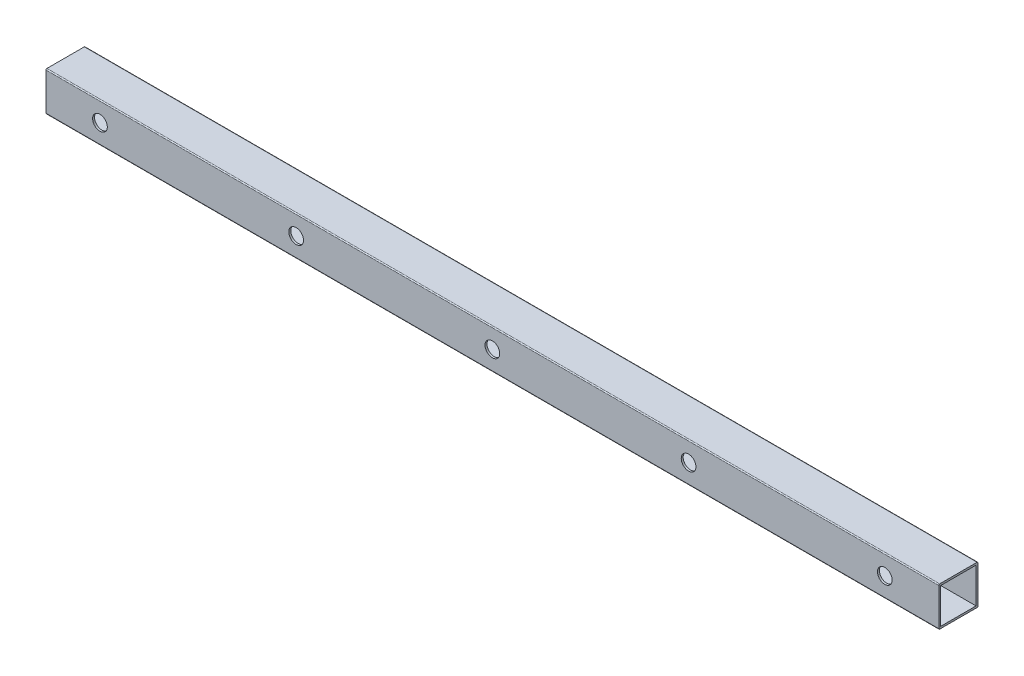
ISO-10303-21;
HEADER;
FILE_DESCRIPTION(('STEP AP214'),'2;1');
FILE_NAME('part.step','',(''),(''),'','','');
FILE_SCHEMA(('AUTOMOTIVE_DESIGN { 1 0 10303 214 1 1 1 1 }'));
ENDSEC;
DATA;
#1=APPLICATION_CONTEXT('core data for automotive mechanical design processes');
#2=APPLICATION_PROTOCOL_DEFINITION('international standard','automotive_design',2000,#1);
#3=PRODUCT_CONTEXT('',#1,'mechanical');
#4=PRODUCT('Part','Part','',(#3));
#5=PRODUCT_RELATED_PRODUCT_CATEGORY('part','',(#4));
#6=PRODUCT_DEFINITION_FORMATION('','',#4);
#7=PRODUCT_DEFINITION_CONTEXT('part definition',#1,'design');
#8=PRODUCT_DEFINITION('design','',#6,#7);
#9=PRODUCT_DEFINITION_SHAPE('','',#8);
#10=(LENGTH_UNIT() NAMED_UNIT(*) SI_UNIT(.MILLI.,.METRE.));
#11=(NAMED_UNIT(*) PLANE_ANGLE_UNIT() SI_UNIT($,.RADIAN.));
#12=(NAMED_UNIT(*) SI_UNIT($,.STERADIAN.) SOLID_ANGLE_UNIT());
#13=UNCERTAINTY_MEASURE_WITH_UNIT(LENGTH_MEASURE(1.E-05),#10,'distance_accuracy_value','');
#14=(GEOMETRIC_REPRESENTATION_CONTEXT(3) GLOBAL_UNCERTAINTY_ASSIGNED_CONTEXT((#13)) GLOBAL_UNIT_ASSIGNED_CONTEXT((#10,
#11,#12)) REPRESENTATION_CONTEXT('',''));
#15=CARTESIAN_POINT('',(0.,0.,0.));
#16=DIRECTION('',(0.,0.,1.));
#17=DIRECTION('',(1.,0.,0.));
#18=AXIS2_PLACEMENT_3D('',#15,#16,#17);
#19=CARTESIAN_POINT('',(227.5,9.49999999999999,9.5));
#20=DIRECTION('',(-1.,0.,0.));
#21=DIRECTION('',(0.,0.,1.));
#22=AXIS2_PLACEMENT_3D('',#19,#20,#21);
#23=PLANE('',#22);
#24=CARTESIAN_POINT('',(227.5,9.49999999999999,9.5));
#25=DIRECTION('',(1.,0.,0.));
#26=DIRECTION('',(0.,0.,1.));
#27=AXIS2_PLACEMENT_3D('',#24,#25,#26);
#28=CIRCLE('',#27,0.5);
#29=CARTESIAN_POINT('',(227.5,9.99999999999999,9.5));
#30=VERTEX_POINT('',#29);
#31=CARTESIAN_POINT('',(227.5,9.49999999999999,10.));
#32=VERTEX_POINT('',#31);
#33=EDGE_CURVE('E161',#30,#32,#28,.T.);
#34=ORIENTED_EDGE('',*,*,#33,.T.);
#35=DIRECTION('',(0.,-1.,0.));
#36=VECTOR('',#35,1.);
#37=CARTESIAN_POINT('',(227.5,-9.50000000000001,10.));
#38=LINE('',#37,#36);
#39=CARTESIAN_POINT('',(227.5,-9.50000000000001,10.));
#40=VERTEX_POINT('',#39);
#41=EDGE_CURVE('E164',#32,#40,#38,.T.);
#42=ORIENTED_EDGE('',*,*,#41,.T.);
#43=CARTESIAN_POINT('',(227.5,-9.50000000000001,9.5));
#44=DIRECTION('',(1.,0.,0.));
#45=DIRECTION('',(0.,0.,1.));
#46=AXIS2_PLACEMENT_3D('',#43,#44,#45);
#47=CIRCLE('',#46,0.5);
#48=CARTESIAN_POINT('',(227.5,-10.,9.5));
#49=VERTEX_POINT('',#48);
#50=EDGE_CURVE('E167',#40,#49,#47,.T.);
#51=ORIENTED_EDGE('',*,*,#50,.T.);
#52=DIRECTION('',(0.,0.,-1.));
#53=VECTOR('',#52,1.);
#54=CARTESIAN_POINT('',(227.5,-10.,9.5));
#55=LINE('',#54,#53);
#56=CARTESIAN_POINT('',(227.5,-10.,-9.49999999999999));
#57=VERTEX_POINT('',#56);
#58=EDGE_CURVE('E169',#49,#57,#55,.T.);
#59=ORIENTED_EDGE('',*,*,#58,.T.);
#60=CARTESIAN_POINT('',(227.5,-9.50000000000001,-9.5));
#61=DIRECTION('',(1.,0.,0.));
#62=DIRECTION('',(0.,0.,-1.));
#63=AXIS2_PLACEMENT_3D('',#60,#61,#62);
#64=CIRCLE('',#63,0.5);
#65=CARTESIAN_POINT('',(227.5,-9.50000000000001,-10.));
#66=VERTEX_POINT('',#65);
#67=EDGE_CURVE('E171',#57,#66,#64,.T.);
#68=ORIENTED_EDGE('',*,*,#67,.T.);
#69=DIRECTION('',(0.,1.,0.));
#70=VECTOR('',#69,1.);
#71=CARTESIAN_POINT('',(227.5,-9.50000000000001,-10.));
#72=LINE('',#71,#70);
#73=CARTESIAN_POINT('',(227.5,9.49999999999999,-10.));
#74=VERTEX_POINT('',#73);
#75=EDGE_CURVE('E173',#66,#74,#72,.T.);
#76=ORIENTED_EDGE('',*,*,#75,.T.);
#77=CARTESIAN_POINT('',(227.5,9.49999999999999,-9.5));
#78=DIRECTION('',(1.,0.,0.));
#79=DIRECTION('',(0.,0.,1.));
#80=AXIS2_PLACEMENT_3D('',#77,#78,#79);
#81=CIRCLE('',#80,0.5);
#82=CARTESIAN_POINT('',(227.5,9.99999999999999,-9.49999999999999));
#83=VERTEX_POINT('',#82);
#84=EDGE_CURVE('E175',#74,#83,#81,.T.);
#85=ORIENTED_EDGE('',*,*,#84,.T.);
#86=DIRECTION('',(0.,0.,1.));
#87=VECTOR('',#86,1.);
#88=CARTESIAN_POINT('',(227.5,9.99999999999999,9.5));
#89=LINE('',#88,#87);
#90=EDGE_CURVE('E177',#83,#30,#89,.T.);
#91=ORIENTED_EDGE('',*,*,#90,.T.);
#92=EDGE_LOOP('',(#34,#42,#51,#59,#68,#76,#85,#91));
#93=FACE_BOUND('',#92,.T.);
#94=DIRECTION('',(0.,0.,-1.));
#95=VECTOR('',#94,1.);
#96=CARTESIAN_POINT('',(227.5,-9.00000000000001,9.00000000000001));
#97=LINE('',#96,#95);
#98=CARTESIAN_POINT('',(227.5,-9.00000000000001,9.00000000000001));
#99=VERTEX_POINT('',#98);
#100=CARTESIAN_POINT('',(227.5,-9.00000000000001,-9.));
#101=VERTEX_POINT('',#100);
#102=EDGE_CURVE('E123',#99,#101,#97,.T.);
#103=ORIENTED_EDGE('',*,*,#102,.F.);
#104=DIRECTION('',(0.,-1.,0.));
#105=VECTOR('',#104,1.);
#106=CARTESIAN_POINT('',(227.5,-9.00000000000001,9.00000000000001));
#107=LINE('',#106,#105);
#108=CARTESIAN_POINT('',(227.5,8.99999999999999,9.00000000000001));
#109=VERTEX_POINT('',#108);
#110=EDGE_CURVE('E145',#109,#99,#107,.T.);
#111=ORIENTED_EDGE('',*,*,#110,.F.);
#112=DIRECTION('',(0.,0.,1.));
#113=VECTOR('',#112,1.);
#114=CARTESIAN_POINT('',(227.5,8.99999999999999,9.00000000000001));
#115=LINE('',#114,#113);
#116=CARTESIAN_POINT('',(227.5,8.99999999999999,-9.));
#117=VERTEX_POINT('',#116);
#118=EDGE_CURVE('E143',#117,#109,#115,.T.);
#119=ORIENTED_EDGE('',*,*,#118,.F.);
#120=DIRECTION('',(0.,1.,0.));
#121=VECTOR('',#120,1.);
#122=CARTESIAN_POINT('',(227.5,-9.00000000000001,-9.));
#123=LINE('',#122,#121);
#124=EDGE_CURVE('E131',#101,#117,#123,.T.);
#125=ORIENTED_EDGE('',*,*,#124,.F.);
#126=EDGE_LOOP('',(#103,#111,#119,#125));
#127=FACE_BOUND('',#126,.T.);
#128=ADVANCED_FACE('F32',(#93,#127),#23,.F.);
#129=CARTESIAN_POINT('',(-227.5,9.49999999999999,9.5));
#130=DIRECTION('',(-1.,0.,0.));
#131=DIRECTION('',(0.,0.,1.));
#132=AXIS2_PLACEMENT_3D('',#129,#130,#131);
#133=PLANE('',#132);
#134=CARTESIAN_POINT('',(-227.5,9.49999999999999,9.5));
#135=DIRECTION('',(1.,0.,0.));
#136=DIRECTION('',(0.,0.,1.));
#137=AXIS2_PLACEMENT_3D('',#134,#135,#136);
#138=CIRCLE('',#137,0.5);
#139=CARTESIAN_POINT('',(-227.5,9.99999999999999,9.5));
#140=VERTEX_POINT('',#139);
#141=CARTESIAN_POINT('',(-227.5,9.49999999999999,10.));
#142=VERTEX_POINT('',#141);
#143=EDGE_CURVE('E139',#140,#142,#138,.T.);
#144=ORIENTED_EDGE('',*,*,#143,.F.);
#145=DIRECTION('',(0.,0.,1.));
#146=VECTOR('',#145,1.);
#147=CARTESIAN_POINT('',(-227.5,9.99999999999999,9.5));
#148=LINE('',#147,#146);
#149=CARTESIAN_POINT('',(-227.5,9.99999999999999,-9.49999999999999));
#150=VERTEX_POINT('',#149);
#151=EDGE_CURVE('E165',#150,#140,#148,.T.);
#152=ORIENTED_EDGE('',*,*,#151,.F.);
#153=CARTESIAN_POINT('',(-227.5,9.49999999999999,-9.5));
#154=DIRECTION('',(1.,0.,0.));
#155=DIRECTION('',(0.,0.,1.));
#156=AXIS2_PLACEMENT_3D('',#153,#154,#155);
#157=CIRCLE('',#156,0.5);
#158=CARTESIAN_POINT('',(-227.5,9.49999999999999,-10.));
#159=VERTEX_POINT('',#158);
#160=EDGE_CURVE('E192',#159,#150,#157,.T.);
#161=ORIENTED_EDGE('',*,*,#160,.F.);
#162=DIRECTION('',(0.,1.,0.));
#163=VECTOR('',#162,1.);
#164=CARTESIAN_POINT('',(-227.5,-9.50000000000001,-10.));
#165=LINE('',#164,#163);
#166=CARTESIAN_POINT('',(-227.5,-9.50000000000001,-10.));
#167=VERTEX_POINT('',#166);
#168=EDGE_CURVE('E190',#167,#159,#165,.T.);
#169=ORIENTED_EDGE('',*,*,#168,.F.);
#170=CARTESIAN_POINT('',(-227.5,-9.50000000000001,-9.5));
#171=DIRECTION('',(1.,0.,0.));
#172=DIRECTION('',(0.,0.,-1.));
#173=AXIS2_PLACEMENT_3D('',#170,#171,#172);
#174=CIRCLE('',#173,0.5);
#175=CARTESIAN_POINT('',(-227.5,-10.,-9.49999999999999));
#176=VERTEX_POINT('',#175);
#177=EDGE_CURVE('E188',#176,#167,#174,.T.);
#178=ORIENTED_EDGE('',*,*,#177,.F.);
#179=DIRECTION('',(0.,0.,-1.));
#180=VECTOR('',#179,1.);
#181=CARTESIAN_POINT('',(-227.5,-10.,9.5));
#182=LINE('',#181,#180);
#183=CARTESIAN_POINT('',(-227.5,-10.,9.5));
#184=VERTEX_POINT('',#183);
#185=EDGE_CURVE('E186',#184,#176,#182,.T.);
#186=ORIENTED_EDGE('',*,*,#185,.F.);
#187=CARTESIAN_POINT('',(-227.5,-9.50000000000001,9.5));
#188=DIRECTION('',(1.,0.,0.));
#189=DIRECTION('',(0.,0.,1.));
#190=AXIS2_PLACEMENT_3D('',#187,#188,#189);
#191=CIRCLE('',#190,0.5);
#192=CARTESIAN_POINT('',(-227.5,-9.50000000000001,10.));
#193=VERTEX_POINT('',#192);
#194=EDGE_CURVE('E184',#193,#184,#191,.T.);
#195=ORIENTED_EDGE('',*,*,#194,.F.);
#196=DIRECTION('',(0.,-1.,0.));
#197=VECTOR('',#196,1.);
#198=CARTESIAN_POINT('',(-227.5,-9.50000000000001,10.));
#199=LINE('',#198,#197);
#200=EDGE_CURVE('E182',#142,#193,#199,.T.);
#201=ORIENTED_EDGE('',*,*,#200,.F.);
#202=EDGE_LOOP('',(#144,#152,#161,#169,#178,#186,#195,#201));
#203=FACE_BOUND('',#202,.T.);
#204=DIRECTION('',(0.,-1.,0.));
#205=VECTOR('',#204,1.);
#206=CARTESIAN_POINT('',(-227.5,-9.00000000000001,9.00000000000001));
#207=LINE('',#206,#205);
#208=CARTESIAN_POINT('',(-227.5,8.99999999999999,9.00000000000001));
#209=VERTEX_POINT('',#208);
#210=CARTESIAN_POINT('',(-227.5,-9.00000000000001,9.00000000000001));
#211=VERTEX_POINT('',#210);
#212=EDGE_CURVE('E132',#209,#211,#207,.T.);
#213=ORIENTED_EDGE('',*,*,#212,.T.);
#214=DIRECTION('',(0.,0.,-1.));
#215=VECTOR('',#214,1.);
#216=CARTESIAN_POINT('',(-227.5,-9.00000000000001,9.00000000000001));
#217=LINE('',#216,#215);
#218=CARTESIAN_POINT('',(-227.5,-9.00000000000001,-9.));
#219=VERTEX_POINT('',#218);
#220=EDGE_CURVE('E57',#211,#219,#217,.T.);
#221=ORIENTED_EDGE('',*,*,#220,.T.);
#222=DIRECTION('',(0.,1.,0.));
#223=VECTOR('',#222,1.);
#224=CARTESIAN_POINT('',(-227.5,-9.00000000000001,-9.));
#225=LINE('',#224,#223);
#226=CARTESIAN_POINT('',(-227.5,8.99999999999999,-9.));
#227=VERTEX_POINT('',#226);
#228=EDGE_CURVE('E138',#219,#227,#225,.T.);
#229=ORIENTED_EDGE('',*,*,#228,.T.);
#230=DIRECTION('',(0.,0.,1.));
#231=VECTOR('',#230,1.);
#232=CARTESIAN_POINT('',(-227.5,8.99999999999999,9.00000000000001));
#233=LINE('',#232,#231);
#234=EDGE_CURVE('E153',#227,#209,#233,.T.);
#235=ORIENTED_EDGE('',*,*,#234,.T.);
#236=EDGE_LOOP('',(#213,#221,#229,#235));
#237=FACE_BOUND('',#236,.T.);
#238=ADVANCED_FACE('F370',(#203,#237),#133,.T.);
#239=CARTESIAN_POINT('',(227.5,9.49999999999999,9.5));
#240=DIRECTION('',(-1.,0.,0.));
#241=DIRECTION('',(0.,0.,1.));
#242=AXIS2_PLACEMENT_3D('',#239,#240,#241);
#243=CYLINDRICAL_SURFACE('',#242,0.5);
#244=ORIENTED_EDGE('',*,*,#143,.T.);
#245=DIRECTION('',(-1.,0.,0.));
#246=VECTOR('',#245,1.);
#247=CARTESIAN_POINT('',(227.5,9.49999999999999,10.));
#248=LINE('',#247,#246);
#249=EDGE_CURVE('E11',#32,#142,#248,.T.);
#250=ORIENTED_EDGE('',*,*,#249,.F.);
#251=ORIENTED_EDGE('',*,*,#33,.F.);
#252=DIRECTION('',(-1.,0.,0.));
#253=VECTOR('',#252,1.);
#254=CARTESIAN_POINT('',(227.5,9.99999999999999,9.5));
#255=LINE('',#254,#253);
#256=EDGE_CURVE('E179',#30,#140,#255,.T.);
#257=ORIENTED_EDGE('',*,*,#256,.T.);
#258=EDGE_LOOP('',(#244,#250,#251,#257));
#259=FACE_BOUND('',#258,.T.);
#260=ADVANCED_FACE('F34',(#259),#243,.T.);
#261=CARTESIAN_POINT('',(227.5,-9.50000000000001,10.));
#262=DIRECTION('',(0.,0.,-1.));
#263=DIRECTION('',(-1.,0.,0.));
#264=AXIS2_PLACEMENT_3D('',#261,#262,#263);
#265=PLANE('',#264);
#266=CARTESIAN_POINT('',(-200.,0.,10.));
#267=DIRECTION('',(0.,0.,-1.));
#268=DIRECTION('',(-1.,0.,0.));
#269=AXIS2_PLACEMENT_3D('',#266,#267,#268);
#270=CIRCLE('',#269,3.74999999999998);
#271=CARTESIAN_POINT('',(-203.75,0.,10.));
#272=VERTEX_POINT('',#271);
#273=EDGE_CURVE('E237',#272,#272,#270,.T.);
#274=ORIENTED_EDGE('',*,*,#273,.T.);
#275=EDGE_LOOP('',(#274));
#276=FACE_BOUND('',#275,.T.);
#277=CARTESIAN_POINT('',(-100.,0.,10.));
#278=DIRECTION('',(0.,0.,-1.));
#279=DIRECTION('',(-1.,0.,0.));
#280=AXIS2_PLACEMENT_3D('',#277,#278,#279);
#281=CIRCLE('',#280,3.74999999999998);
#282=CARTESIAN_POINT('',(-103.75,0.,10.));
#283=VERTEX_POINT('',#282);
#284=EDGE_CURVE('E232',#283,#283,#281,.T.);
#285=ORIENTED_EDGE('',*,*,#284,.T.);
#286=EDGE_LOOP('',(#285));
#287=FACE_BOUND('',#286,.T.);
#288=CARTESIAN_POINT('',(0.,0.,10.));
#289=DIRECTION('',(0.,0.,-1.));
#290=DIRECTION('',(-1.,0.,0.));
#291=AXIS2_PLACEMENT_3D('',#288,#289,#290);
#292=CIRCLE('',#291,3.74999999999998);
#293=CARTESIAN_POINT('',(-3.74999999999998,0.,10.));
#294=VERTEX_POINT('',#293);
#295=EDGE_CURVE('E227',#294,#294,#292,.T.);
#296=ORIENTED_EDGE('',*,*,#295,.T.);
#297=EDGE_LOOP('',(#296));
#298=FACE_BOUND('',#297,.T.);
#299=CARTESIAN_POINT('',(100.,0.,10.));
#300=DIRECTION('',(0.,0.,-1.));
#301=DIRECTION('',(-1.,0.,0.));
#302=AXIS2_PLACEMENT_3D('',#299,#300,#301);
#303=CIRCLE('',#302,3.74999999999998);
#304=CARTESIAN_POINT('',(96.25,0.,10.));
#305=VERTEX_POINT('',#304);
#306=EDGE_CURVE('E222',#305,#305,#303,.T.);
#307=ORIENTED_EDGE('',*,*,#306,.T.);
#308=EDGE_LOOP('',(#307));
#309=FACE_BOUND('',#308,.T.);
#310=CARTESIAN_POINT('',(200.,0.,10.));
#311=DIRECTION('',(0.,0.,-1.));
#312=DIRECTION('',(-1.,0.,0.));
#313=AXIS2_PLACEMENT_3D('',#310,#311,#312);
#314=CIRCLE('',#313,3.74999999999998);
#315=CARTESIAN_POINT('',(196.25,0.,10.));
#316=VERTEX_POINT('',#315);
#317=EDGE_CURVE('E217',#316,#316,#314,.T.);
#318=ORIENTED_EDGE('',*,*,#317,.T.);
#319=EDGE_LOOP('',(#318));
#320=FACE_BOUND('',#319,.T.);
#321=ORIENTED_EDGE('',*,*,#200,.T.);
#322=DIRECTION('',(-1.,0.,0.));
#323=VECTOR('',#322,1.);
#324=CARTESIAN_POINT('',(227.5,-9.50000000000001,10.));
#325=LINE('',#324,#323);
#326=EDGE_CURVE('E41',#40,#193,#325,.T.);
#327=ORIENTED_EDGE('',*,*,#326,.F.);
#328=ORIENTED_EDGE('',*,*,#41,.F.);
#329=ORIENTED_EDGE('',*,*,#249,.T.);
#330=EDGE_LOOP('',(#321,#327,#328,#329));
#331=FACE_BOUND('',#330,.T.);
#332=ADVANCED_FACE('F400',(#276,#287,#298,#309,#320,#331),#265,.F.);
#333=CARTESIAN_POINT('',(227.5,-9.50000000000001,9.5));
#334=DIRECTION('',(-1.,0.,0.));
#335=DIRECTION('',(0.,0.,1.));
#336=AXIS2_PLACEMENT_3D('',#333,#334,#335);
#337=CYLINDRICAL_SURFACE('',#336,0.5);
#338=ORIENTED_EDGE('',*,*,#194,.T.);
#339=DIRECTION('',(-1.,0.,0.));
#340=VECTOR('',#339,1.);
#341=CARTESIAN_POINT('',(227.5,-10.,9.5));
#342=LINE('',#341,#340);
#343=EDGE_CURVE('E209',#49,#184,#342,.T.);
#344=ORIENTED_EDGE('',*,*,#343,.F.);
#345=ORIENTED_EDGE('',*,*,#50,.F.);
#346=ORIENTED_EDGE('',*,*,#326,.T.);
#347=EDGE_LOOP('',(#338,#344,#345,#346));
#348=FACE_BOUND('',#347,.T.);
#349=ADVANCED_FACE('F397',(#348),#337,.T.);
#350=CARTESIAN_POINT('',(227.5,-10.,9.5));
#351=DIRECTION('',(0.,1.,0.));
#352=DIRECTION('',(0.,0.,1.));
#353=AXIS2_PLACEMENT_3D('',#350,#351,#352);
#354=PLANE('',#353);
#355=ORIENTED_EDGE('',*,*,#185,.T.);
#356=DIRECTION('',(-1.,0.,0.));
#357=VECTOR('',#356,1.);
#358=CARTESIAN_POINT('',(227.5,-10.,-9.49999999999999));
#359=LINE('',#358,#357);
#360=EDGE_CURVE('E206',#57,#176,#359,.T.);
#361=ORIENTED_EDGE('',*,*,#360,.F.);
#362=ORIENTED_EDGE('',*,*,#58,.F.);
#363=ORIENTED_EDGE('',*,*,#343,.T.);
#364=EDGE_LOOP('',(#355,#361,#362,#363));
#365=FACE_BOUND('',#364,.T.);
#366=ADVANCED_FACE('F393',(#365),#354,.F.);
#367=CARTESIAN_POINT('',(227.5,-9.50000000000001,-9.5));
#368=DIRECTION('',(-1.,0.,0.));
#369=DIRECTION('',(0.,0.,1.));
#370=AXIS2_PLACEMENT_3D('',#367,#368,#369);
#371=CYLINDRICAL_SURFACE('',#370,0.5);
#372=ORIENTED_EDGE('',*,*,#177,.T.);
#373=DIRECTION('',(-1.,0.,0.));
#374=VECTOR('',#373,1.);
#375=CARTESIAN_POINT('',(227.5,-9.50000000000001,-10.));
#376=LINE('',#375,#374);
#377=EDGE_CURVE('E203',#66,#167,#376,.T.);
#378=ORIENTED_EDGE('',*,*,#377,.F.);
#379=ORIENTED_EDGE('',*,*,#67,.F.);
#380=ORIENTED_EDGE('',*,*,#360,.T.);
#381=EDGE_LOOP('',(#372,#378,#379,#380));
#382=FACE_BOUND('',#381,.T.);
#383=ADVANCED_FACE('F389',(#382),#371,.T.);
#384=CARTESIAN_POINT('',(227.5,-9.50000000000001,-10.));
#385=DIRECTION('',(0.,0.,1.));
#386=DIRECTION('',(1.,0.,0.));
#387=AXIS2_PLACEMENT_3D('',#384,#385,#386);
#388=PLANE('',#387);
#389=CARTESIAN_POINT('',(-225.,0.,-10.));
#390=DIRECTION('',(0.,0.,-1.));
#391=DIRECTION('',(-1.,0.,0.));
#392=AXIS2_PLACEMENT_3D('',#389,#390,#391);
#393=CIRCLE('',#392,2.24999999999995);
#394=CARTESIAN_POINT('',(-227.25,0.,-10.));
#395=VERTEX_POINT('',#394);
#396=EDGE_CURVE('E294',#395,#395,#393,.T.);
#397=ORIENTED_EDGE('',*,*,#396,.F.);
#398=EDGE_LOOP('',(#397));
#399=FACE_BOUND('',#398,.T.);
#400=CARTESIAN_POINT('',(-175.,0.,-10.));
#401=DIRECTION('',(0.,0.,-1.));
#402=DIRECTION('',(-1.,0.,0.));
#403=AXIS2_PLACEMENT_3D('',#400,#401,#402);
#404=CIRCLE('',#403,2.25000000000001);
#405=CARTESIAN_POINT('',(-177.25,0.,-10.));
#406=VERTEX_POINT('',#405);
#407=EDGE_CURVE('E284',#406,#406,#404,.T.);
#408=ORIENTED_EDGE('',*,*,#407,.F.);
#409=EDGE_LOOP('',(#408));
#410=FACE_BOUND('',#409,.T.);
#411=CARTESIAN_POINT('',(-150.,0.,-10.));
#412=DIRECTION('',(0.,0.,-1.));
#413=DIRECTION('',(-1.,0.,0.));
#414=AXIS2_PLACEMENT_3D('',#411,#412,#413);
#415=CIRCLE('',#414,2.25000000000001);
#416=CARTESIAN_POINT('',(-152.25,0.,-10.));
#417=VERTEX_POINT('',#416);
#418=EDGE_CURVE('E281',#417,#417,#415,.T.);
#419=ORIENTED_EDGE('',*,*,#418,.F.);
#420=EDGE_LOOP('',(#419));
#421=FACE_BOUND('',#420,.T.);
#422=CARTESIAN_POINT('',(-125.,0.,-10.));
#423=DIRECTION('',(0.,0.,-1.));
#424=DIRECTION('',(-1.,0.,0.));
#425=AXIS2_PLACEMENT_3D('',#422,#423,#424);
#426=CIRCLE('',#425,2.24999999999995);
#427=CARTESIAN_POINT('',(-127.25,0.,-10.));
#428=VERTEX_POINT('',#427);
#429=EDGE_CURVE('E278',#428,#428,#426,.T.);
#430=ORIENTED_EDGE('',*,*,#429,.F.);
#431=EDGE_LOOP('',(#430));
#432=FACE_BOUND('',#431,.T.);
#433=CARTESIAN_POINT('',(-75.,0.,-10.));
#434=DIRECTION('',(0.,0.,-1.));
#435=DIRECTION('',(-1.,0.,0.));
#436=AXIS2_PLACEMENT_3D('',#433,#434,#435);
#437=CIRCLE('',#436,2.25000000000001);
#438=CARTESIAN_POINT('',(-77.25,0.,-10.));
#439=VERTEX_POINT('',#438);
#440=EDGE_CURVE('E274',#439,#439,#437,.T.);
#441=ORIENTED_EDGE('',*,*,#440,.F.);
#442=EDGE_LOOP('',(#441));
#443=FACE_BOUND('',#442,.T.);
#444=CARTESIAN_POINT('',(-50.,0.,-10.));
#445=DIRECTION('',(0.,0.,-1.));
#446=DIRECTION('',(-1.,0.,0.));
#447=AXIS2_PLACEMENT_3D('',#444,#445,#446);
#448=CIRCLE('',#447,2.25000000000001);
#449=CARTESIAN_POINT('',(-52.25,0.,-10.));
#450=VERTEX_POINT('',#449);
#451=EDGE_CURVE('E270',#450,#450,#448,.T.);
#452=ORIENTED_EDGE('',*,*,#451,.F.);
#453=EDGE_LOOP('',(#452));
#454=FACE_BOUND('',#453,.T.);
#455=CARTESIAN_POINT('',(-25.,0.,-10.));
#456=DIRECTION('',(0.,0.,-1.));
#457=DIRECTION('',(-1.,0.,0.));
#458=AXIS2_PLACEMENT_3D('',#455,#456,#457);
#459=CIRCLE('',#458,2.24999999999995);
#460=CARTESIAN_POINT('',(-27.2499999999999,0.,-10.));
#461=VERTEX_POINT('',#460);
#462=EDGE_CURVE('E266',#461,#461,#459,.T.);
#463=ORIENTED_EDGE('',*,*,#462,.F.);
#464=EDGE_LOOP('',(#463));
#465=FACE_BOUND('',#464,.T.);
#466=CARTESIAN_POINT('',(25.,0.,-10.));
#467=DIRECTION('',(0.,0.,-1.));
#468=DIRECTION('',(-1.,0.,0.));
#469=AXIS2_PLACEMENT_3D('',#466,#467,#468);
#470=CIRCLE('',#469,2.25000000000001);
#471=CARTESIAN_POINT('',(22.75,0.,-10.));
#472=VERTEX_POINT('',#471);
#473=EDGE_CURVE('E262',#472,#472,#470,.T.);
#474=ORIENTED_EDGE('',*,*,#473,.F.);
#475=EDGE_LOOP('',(#474));
#476=FACE_BOUND('',#475,.T.);
#477=CARTESIAN_POINT('',(50.,0.,-10.));
#478=DIRECTION('',(0.,0.,-1.));
#479=DIRECTION('',(-1.,0.,0.));
#480=AXIS2_PLACEMENT_3D('',#477,#478,#479);
#481=CIRCLE('',#480,2.25000000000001);
#482=CARTESIAN_POINT('',(47.75,0.,-10.));
#483=VERTEX_POINT('',#482);
#484=EDGE_CURVE('E258',#483,#483,#481,.T.);
#485=ORIENTED_EDGE('',*,*,#484,.F.);
#486=EDGE_LOOP('',(#485));
#487=FACE_BOUND('',#486,.T.);
#488=CARTESIAN_POINT('',(75.,0.,-10.));
#489=DIRECTION('',(0.,0.,-1.));
#490=DIRECTION('',(-1.,0.,0.));
#491=AXIS2_PLACEMENT_3D('',#488,#489,#490);
#492=CIRCLE('',#491,2.24999999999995);
#493=CARTESIAN_POINT('',(72.7500000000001,0.,-10.));
#494=VERTEX_POINT('',#493);
#495=EDGE_CURVE('E254',#494,#494,#492,.T.);
#496=ORIENTED_EDGE('',*,*,#495,.F.);
#497=EDGE_LOOP('',(#496));
#498=FACE_BOUND('',#497,.T.);
#499=CARTESIAN_POINT('',(125.,0.,-10.));
#500=DIRECTION('',(0.,0.,-1.));
#501=DIRECTION('',(-1.,0.,0.));
#502=AXIS2_PLACEMENT_3D('',#499,#500,#501);
#503=CIRCLE('',#502,2.25000000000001);
#504=CARTESIAN_POINT('',(122.75,0.,-10.));
#505=VERTEX_POINT('',#504);
#506=EDGE_CURVE('E250',#505,#505,#503,.T.);
#507=ORIENTED_EDGE('',*,*,#506,.F.);
#508=EDGE_LOOP('',(#507));
#509=FACE_BOUND('',#508,.T.);
#510=CARTESIAN_POINT('',(150.,0.,-10.));
#511=DIRECTION('',(0.,0.,-1.));
#512=DIRECTION('',(-1.,0.,0.));
#513=AXIS2_PLACEMENT_3D('',#510,#511,#512);
#514=CIRCLE('',#513,2.25000000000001);
#515=CARTESIAN_POINT('',(147.75,0.,-10.));
#516=VERTEX_POINT('',#515);
#517=EDGE_CURVE('E246',#516,#516,#514,.T.);
#518=ORIENTED_EDGE('',*,*,#517,.F.);
#519=EDGE_LOOP('',(#518));
#520=FACE_BOUND('',#519,.T.);
#521=CARTESIAN_POINT('',(175.,0.,-10.));
#522=DIRECTION('',(0.,0.,-1.));
#523=DIRECTION('',(-1.,0.,0.));
#524=AXIS2_PLACEMENT_3D('',#521,#522,#523);
#525=CIRCLE('',#524,2.24999999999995);
#526=CARTESIAN_POINT('',(172.75,0.,-10.));
#527=VERTEX_POINT('',#526);
#528=EDGE_CURVE('E242',#527,#527,#525,.T.);
#529=ORIENTED_EDGE('',*,*,#528,.F.);
#530=EDGE_LOOP('',(#529));
#531=FACE_BOUND('',#530,.T.);
#532=CARTESIAN_POINT('',(-200.,0.,-10.));
#533=DIRECTION('',(0.,0.,-1.));
#534=DIRECTION('',(-1.,0.,0.));
#535=AXIS2_PLACEMENT_3D('',#532,#533,#534);
#536=CIRCLE('',#535,3.74999999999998);
#537=CARTESIAN_POINT('',(-203.75,0.,-10.));
#538=VERTEX_POINT('',#537);
#539=EDGE_CURVE('E241',#538,#538,#536,.T.);
#540=ORIENTED_EDGE('',*,*,#539,.F.);
#541=EDGE_LOOP('',(#540));
#542=FACE_BOUND('',#541,.T.);
#543=CARTESIAN_POINT('',(-100.,0.,-10.));
#544=DIRECTION('',(0.,0.,-1.));
#545=DIRECTION('',(-1.,0.,0.));
#546=AXIS2_PLACEMENT_3D('',#543,#544,#545);
#547=CIRCLE('',#546,3.74999999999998);
#548=CARTESIAN_POINT('',(-103.75,0.,-10.));
#549=VERTEX_POINT('',#548);
#550=EDGE_CURVE('E323',#549,#549,#547,.T.);
#551=ORIENTED_EDGE('',*,*,#550,.F.);
#552=EDGE_LOOP('',(#551));
#553=FACE_BOUND('',#552,.T.);
#554=CARTESIAN_POINT('',(0.,0.,-10.));
#555=DIRECTION('',(0.,0.,-1.));
#556=DIRECTION('',(-1.,0.,0.));
#557=AXIS2_PLACEMENT_3D('',#554,#555,#556);
#558=CIRCLE('',#557,3.74999999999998);
#559=CARTESIAN_POINT('',(-3.74999999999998,0.,-10.));
#560=VERTEX_POINT('',#559);
#561=EDGE_CURVE('E330',#560,#560,#558,.T.);
#562=ORIENTED_EDGE('',*,*,#561,.F.);
#563=EDGE_LOOP('',(#562));
#564=FACE_BOUND('',#563,.T.);
#565=CARTESIAN_POINT('',(100.,0.,-10.));
#566=DIRECTION('',(0.,0.,-1.));
#567=DIRECTION('',(-1.,0.,0.));
#568=AXIS2_PLACEMENT_3D('',#565,#566,#567);
#569=CIRCLE('',#568,3.74999999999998);
#570=CARTESIAN_POINT('',(96.25,0.,-10.));
#571=VERTEX_POINT('',#570);
#572=EDGE_CURVE('E337',#571,#571,#569,.T.);
#573=ORIENTED_EDGE('',*,*,#572,.F.);
#574=EDGE_LOOP('',(#573));
#575=FACE_BOUND('',#574,.T.);
#576=CARTESIAN_POINT('',(200.,0.,-10.));
#577=DIRECTION('',(0.,0.,-1.));
#578=DIRECTION('',(-1.,0.,0.));
#579=AXIS2_PLACEMENT_3D('',#576,#577,#578);
#580=CIRCLE('',#579,3.74999999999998);
#581=CARTESIAN_POINT('',(196.25,0.,-10.));
#582=VERTEX_POINT('',#581);
#583=EDGE_CURVE('E344',#582,#582,#580,.T.);
#584=ORIENTED_EDGE('',*,*,#583,.F.);
#585=EDGE_LOOP('',(#584));
#586=FACE_BOUND('',#585,.T.);
#587=ORIENTED_EDGE('',*,*,#168,.T.);
#588=DIRECTION('',(-1.,0.,0.));
#589=VECTOR('',#588,1.);
#590=CARTESIAN_POINT('',(227.5,9.49999999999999,-10.));
#591=LINE('',#590,#589);
#592=EDGE_CURVE('E200',#74,#159,#591,.T.);
#593=ORIENTED_EDGE('',*,*,#592,.F.);
#594=ORIENTED_EDGE('',*,*,#75,.F.);
#595=ORIENTED_EDGE('',*,*,#377,.T.);
#596=EDGE_LOOP('',(#587,#593,#594,#595));
#597=FACE_BOUND('',#596,.T.);
#598=ADVANCED_FACE('F385',(#399,#410,#421,#432,#443,#454,#465,#476,#487,#498,#509,#520,#531,
#542,#553,#564,#575,#586,#597),#388,.F.);
#599=CARTESIAN_POINT('',(227.5,9.49999999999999,-9.5));
#600=DIRECTION('',(-1.,0.,0.));
#601=DIRECTION('',(0.,0.,1.));
#602=AXIS2_PLACEMENT_3D('',#599,#600,#601);
#603=CYLINDRICAL_SURFACE('',#602,0.5);
#604=ORIENTED_EDGE('',*,*,#160,.T.);
#605=DIRECTION('',(-1.,0.,0.));
#606=VECTOR('',#605,1.);
#607=CARTESIAN_POINT('',(227.5,9.99999999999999,-9.49999999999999));
#608=LINE('',#607,#606);
#609=EDGE_CURVE('E197',#83,#150,#608,.T.);
#610=ORIENTED_EDGE('',*,*,#609,.F.);
#611=ORIENTED_EDGE('',*,*,#84,.F.);
#612=ORIENTED_EDGE('',*,*,#592,.T.);
#613=EDGE_LOOP('',(#604,#610,#611,#612));
#614=FACE_BOUND('',#613,.T.);
#615=ADVANCED_FACE('F381',(#614),#603,.T.);
#616=CARTESIAN_POINT('',(227.5,9.99999999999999,9.5));
#617=DIRECTION('',(0.,-1.,0.));
#618=DIRECTION('',(0.,0.,-1.));
#619=AXIS2_PLACEMENT_3D('',#616,#617,#618);
#620=PLANE('',#619);
#621=ORIENTED_EDGE('',*,*,#151,.T.);
#622=ORIENTED_EDGE('',*,*,#256,.F.);
#623=ORIENTED_EDGE('',*,*,#90,.F.);
#624=ORIENTED_EDGE('',*,*,#609,.T.);
#625=EDGE_LOOP('',(#621,#622,#623,#624));
#626=FACE_BOUND('',#625,.T.);
#627=ADVANCED_FACE('F365',(#626),#620,.F.);
#628=CARTESIAN_POINT('',(227.5,-9.00000000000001,9.00000000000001));
#629=DIRECTION('',(0.,1.,0.));
#630=DIRECTION('',(0.,0.,1.));
#631=AXIS2_PLACEMENT_3D('',#628,#629,#630);
#632=PLANE('',#631);
#633=ORIENTED_EDGE('',*,*,#220,.F.);
#634=DIRECTION('',(-1.,0.,0.));
#635=VECTOR('',#634,1.);
#636=CARTESIAN_POINT('',(227.5,-9.00000000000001,9.00000000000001));
#637=LINE('',#636,#635);
#638=EDGE_CURVE('E127',#99,#211,#637,.T.);
#639=ORIENTED_EDGE('',*,*,#638,.F.);
#640=ORIENTED_EDGE('',*,*,#102,.T.);
#641=DIRECTION('',(-1.,0.,0.));
#642=VECTOR('',#641,1.);
#643=CARTESIAN_POINT('',(227.5,-9.00000000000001,-9.));
#644=LINE('',#643,#642);
#645=EDGE_CURVE('E126',#101,#219,#644,.T.);
#646=ORIENTED_EDGE('',*,*,#645,.T.);
#647=EDGE_LOOP('',(#633,#639,#640,#646));
#648=FACE_BOUND('',#647,.T.);
#649=ADVANCED_FACE('F125',(#648),#632,.T.);
#650=CARTESIAN_POINT('',(227.5,-9.00000000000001,-9.));
#651=DIRECTION('',(0.,0.,1.));
#652=DIRECTION('',(0.,-1.,0.));
#653=AXIS2_PLACEMENT_3D('',#650,#651,#652);
#654=PLANE('',#653);
#655=CARTESIAN_POINT('',(-225.,0.,-9.));
#656=DIRECTION('',(0.,0.,1.));
#657=DIRECTION('',(0.,-1.,0.));
#658=AXIS2_PLACEMENT_3D('',#655,#656,#657);
#659=CIRCLE('',#658,2.24999999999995);
#660=CARTESIAN_POINT('',(-225.,-2.24999999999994,-9.));
#661=VERTEX_POINT('',#660);
#662=EDGE_CURVE('E36',#661,#661,#659,.T.);
#663=ORIENTED_EDGE('',*,*,#662,.F.);
#664=EDGE_LOOP('',(#663));
#665=FACE_BOUND('',#664,.T.);
#666=CARTESIAN_POINT('',(-175.,0.,-9.));
#667=DIRECTION('',(0.,0.,1.));
#668=DIRECTION('',(0.,-1.,0.));
#669=AXIS2_PLACEMENT_3D('',#666,#667,#668);
#670=CIRCLE('',#669,2.25000000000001);
#671=CARTESIAN_POINT('',(-175.,-2.25,-9.));
#672=VERTEX_POINT('',#671);
#673=EDGE_CURVE('E282',#672,#672,#670,.T.);
#674=ORIENTED_EDGE('',*,*,#673,.F.);
#675=EDGE_LOOP('',(#674));
#676=FACE_BOUND('',#675,.T.);
#677=CARTESIAN_POINT('',(-150.,0.,-9.));
#678=DIRECTION('',(0.,0.,1.));
#679=DIRECTION('',(0.,-1.,0.));
#680=AXIS2_PLACEMENT_3D('',#677,#678,#679);
#681=CIRCLE('',#680,2.25000000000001);
#682=CARTESIAN_POINT('',(-150.,-2.25,-9.));
#683=VERTEX_POINT('',#682);
#684=EDGE_CURVE('E279',#683,#683,#681,.T.);
#685=ORIENTED_EDGE('',*,*,#684,.F.);
#686=EDGE_LOOP('',(#685));
#687=FACE_BOUND('',#686,.T.);
#688=CARTESIAN_POINT('',(-125.,0.,-9.));
#689=DIRECTION('',(0.,0.,1.));
#690=DIRECTION('',(0.,-1.,0.));
#691=AXIS2_PLACEMENT_3D('',#688,#689,#690);
#692=CIRCLE('',#691,2.24999999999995);
#693=CARTESIAN_POINT('',(-125.,-2.24999999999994,-9.));
#694=VERTEX_POINT('',#693);
#695=EDGE_CURVE('E275',#694,#694,#692,.T.);
#696=ORIENTED_EDGE('',*,*,#695,.F.);
#697=EDGE_LOOP('',(#696));
#698=FACE_BOUND('',#697,.T.);
#699=CARTESIAN_POINT('',(-75.,0.,-9.));
#700=DIRECTION('',(0.,0.,1.));
#701=DIRECTION('',(0.,-1.,0.));
#702=AXIS2_PLACEMENT_3D('',#699,#700,#701);
#703=CIRCLE('',#702,2.25000000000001);
#704=CARTESIAN_POINT('',(-75.,-2.25,-9.));
#705=VERTEX_POINT('',#704);
#706=EDGE_CURVE('E271',#705,#705,#703,.T.);
#707=ORIENTED_EDGE('',*,*,#706,.F.);
#708=EDGE_LOOP('',(#707));
#709=FACE_BOUND('',#708,.T.);
#710=CARTESIAN_POINT('',(-50.,0.,-9.));
#711=DIRECTION('',(0.,0.,1.));
#712=DIRECTION('',(0.,-1.,0.));
#713=AXIS2_PLACEMENT_3D('',#710,#711,#712);
#714=CIRCLE('',#713,2.25000000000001);
#715=CARTESIAN_POINT('',(-50.,-2.25,-9.));
#716=VERTEX_POINT('',#715);
#717=EDGE_CURVE('E267',#716,#716,#714,.T.);
#718=ORIENTED_EDGE('',*,*,#717,.F.);
#719=EDGE_LOOP('',(#718));
#720=FACE_BOUND('',#719,.T.);
#721=CARTESIAN_POINT('',(-25.,0.,-9.));
#722=DIRECTION('',(0.,0.,1.));
#723=DIRECTION('',(0.,-1.,0.));
#724=AXIS2_PLACEMENT_3D('',#721,#722,#723);
#725=CIRCLE('',#724,2.24999999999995);
#726=CARTESIAN_POINT('',(-25.,-2.24999999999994,-9.));
#727=VERTEX_POINT('',#726);
#728=EDGE_CURVE('E263',#727,#727,#725,.T.);
#729=ORIENTED_EDGE('',*,*,#728,.F.);
#730=EDGE_LOOP('',(#729));
#731=FACE_BOUND('',#730,.T.);
#732=CARTESIAN_POINT('',(25.,0.,-9.));
#733=DIRECTION('',(0.,0.,1.));
#734=DIRECTION('',(0.,-1.,0.));
#735=AXIS2_PLACEMENT_3D('',#732,#733,#734);
#736=CIRCLE('',#735,2.25000000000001);
#737=CARTESIAN_POINT('',(25.,-2.25,-9.));
#738=VERTEX_POINT('',#737);
#739=EDGE_CURVE('E259',#738,#738,#736,.T.);
#740=ORIENTED_EDGE('',*,*,#739,.F.);
#741=EDGE_LOOP('',(#740));
#742=FACE_BOUND('',#741,.T.);
#743=CARTESIAN_POINT('',(50.,0.,-9.));
#744=DIRECTION('',(0.,0.,1.));
#745=DIRECTION('',(0.,-1.,0.));
#746=AXIS2_PLACEMENT_3D('',#743,#744,#745);
#747=CIRCLE('',#746,2.25000000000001);
#748=CARTESIAN_POINT('',(50.,-2.25,-9.));
#749=VERTEX_POINT('',#748);
#750=EDGE_CURVE('E255',#749,#749,#747,.T.);
#751=ORIENTED_EDGE('',*,*,#750,.F.);
#752=EDGE_LOOP('',(#751));
#753=FACE_BOUND('',#752,.T.);
#754=CARTESIAN_POINT('',(75.,0.,-9.));
#755=DIRECTION('',(0.,0.,1.));
#756=DIRECTION('',(0.,-1.,0.));
#757=AXIS2_PLACEMENT_3D('',#754,#755,#756);
#758=CIRCLE('',#757,2.24999999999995);
#759=CARTESIAN_POINT('',(75.,-2.24999999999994,-9.));
#760=VERTEX_POINT('',#759);
#761=EDGE_CURVE('E251',#760,#760,#758,.T.);
#762=ORIENTED_EDGE('',*,*,#761,.F.);
#763=EDGE_LOOP('',(#762));
#764=FACE_BOUND('',#763,.T.);
#765=CARTESIAN_POINT('',(125.,0.,-9.));
#766=DIRECTION('',(0.,0.,1.));
#767=DIRECTION('',(0.,-1.,0.));
#768=AXIS2_PLACEMENT_3D('',#765,#766,#767);
#769=CIRCLE('',#768,2.25000000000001);
#770=CARTESIAN_POINT('',(125.,-2.25,-9.));
#771=VERTEX_POINT('',#770);
#772=EDGE_CURVE('E247',#771,#771,#769,.T.);
#773=ORIENTED_EDGE('',*,*,#772,.F.);
#774=EDGE_LOOP('',(#773));
#775=FACE_BOUND('',#774,.T.);
#776=CARTESIAN_POINT('',(150.,0.,-9.));
#777=DIRECTION('',(0.,0.,1.));
#778=DIRECTION('',(0.,-1.,0.));
#779=AXIS2_PLACEMENT_3D('',#776,#777,#778);
#780=CIRCLE('',#779,2.25000000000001);
#781=CARTESIAN_POINT('',(150.,-2.25,-9.));
#782=VERTEX_POINT('',#781);
#783=EDGE_CURVE('E243',#782,#782,#780,.T.);
#784=ORIENTED_EDGE('',*,*,#783,.F.);
#785=EDGE_LOOP('',(#784));
#786=FACE_BOUND('',#785,.T.);
#787=CARTESIAN_POINT('',(175.,0.,-9.));
#788=DIRECTION('',(0.,0.,1.));
#789=DIRECTION('',(0.,-1.,0.));
#790=AXIS2_PLACEMENT_3D('',#787,#788,#789);
#791=CIRCLE('',#790,2.24999999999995);
#792=CARTESIAN_POINT('',(175.,-2.24999999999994,-9.));
#793=VERTEX_POINT('',#792);
#794=EDGE_CURVE('E238',#793,#793,#791,.T.);
#795=ORIENTED_EDGE('',*,*,#794,.F.);
#796=EDGE_LOOP('',(#795));
#797=FACE_BOUND('',#796,.T.);
#798=CARTESIAN_POINT('',(-200.,0.,-9.));
#799=DIRECTION('',(0.,0.,1.));
#800=DIRECTION('',(0.,-1.,0.));
#801=AXIS2_PLACEMENT_3D('',#798,#799,#800);
#802=CIRCLE('',#801,3.74999999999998);
#803=CARTESIAN_POINT('',(-200.,-3.74999999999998,-9.));
#804=VERTEX_POINT('',#803);
#805=EDGE_CURVE('E236',#804,#804,#802,.T.);
#806=ORIENTED_EDGE('',*,*,#805,.F.);
#807=EDGE_LOOP('',(#806));
#808=FACE_BOUND('',#807,.T.);
#809=CARTESIAN_POINT('',(-100.,0.,-9.));
#810=DIRECTION('',(0.,0.,1.));
#811=DIRECTION('',(0.,-1.,0.));
#812=AXIS2_PLACEMENT_3D('',#809,#810,#811);
#813=CIRCLE('',#812,3.74999999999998);
#814=CARTESIAN_POINT('',(-100.,-3.74999999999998,-9.));
#815=VERTEX_POINT('',#814);
#816=EDGE_CURVE('E231',#815,#815,#813,.T.);
#817=ORIENTED_EDGE('',*,*,#816,.F.);
#818=EDGE_LOOP('',(#817));
#819=FACE_BOUND('',#818,.T.);
#820=CARTESIAN_POINT('',(0.,0.,-9.));
#821=DIRECTION('',(0.,0.,1.));
#822=DIRECTION('',(0.,-1.,0.));
#823=AXIS2_PLACEMENT_3D('',#820,#821,#822);
#824=CIRCLE('',#823,3.74999999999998);
#825=CARTESIAN_POINT('',(0.,-3.74999999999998,-9.));
#826=VERTEX_POINT('',#825);
#827=EDGE_CURVE('E226',#826,#826,#824,.T.);
#828=ORIENTED_EDGE('',*,*,#827,.F.);
#829=EDGE_LOOP('',(#828));
#830=FACE_BOUND('',#829,.T.);
#831=CARTESIAN_POINT('',(100.,0.,-9.));
#832=DIRECTION('',(0.,0.,1.));
#833=DIRECTION('',(0.,-1.,0.));
#834=AXIS2_PLACEMENT_3D('',#831,#832,#833);
#835=CIRCLE('',#834,3.74999999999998);
#836=CARTESIAN_POINT('',(100.,-3.74999999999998,-9.));
#837=VERTEX_POINT('',#836);
#838=EDGE_CURVE('E221',#837,#837,#835,.T.);
#839=ORIENTED_EDGE('',*,*,#838,.F.);
#840=EDGE_LOOP('',(#839));
#841=FACE_BOUND('',#840,.T.);
#842=CARTESIAN_POINT('',(200.,0.,-9.));
#843=DIRECTION('',(0.,0.,1.));
#844=DIRECTION('',(0.,-1.,0.));
#845=AXIS2_PLACEMENT_3D('',#842,#843,#844);
#846=CIRCLE('',#845,3.74999999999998);
#847=CARTESIAN_POINT('',(200.,-3.74999999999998,-9.));
#848=VERTEX_POINT('',#847);
#849=EDGE_CURVE('E151',#848,#848,#846,.T.);
#850=ORIENTED_EDGE('',*,*,#849,.F.);
#851=EDGE_LOOP('',(#850));
#852=FACE_BOUND('',#851,.T.);
#853=ORIENTED_EDGE('',*,*,#228,.F.);
#854=ORIENTED_EDGE('',*,*,#645,.F.);
#855=ORIENTED_EDGE('',*,*,#124,.T.);
#856=DIRECTION('',(-1.,0.,0.));
#857=VECTOR('',#856,1.);
#858=CARTESIAN_POINT('',(227.5,8.99999999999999,-9.));
#859=LINE('',#858,#857);
#860=EDGE_CURVE('E140',#117,#227,#859,.T.);
#861=ORIENTED_EDGE('',*,*,#860,.T.);
#862=EDGE_LOOP('',(#853,#854,#855,#861));
#863=FACE_BOUND('',#862,.T.);
#864=ADVANCED_FACE('F135',(#665,#676,#687,#698,#709,#720,#731,#742,#753,#764,#775,#786,#797,
#808,#819,#830,#841,#852,#863),#654,.T.);
#865=CARTESIAN_POINT('',(227.5,8.99999999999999,9.00000000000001));
#866=DIRECTION('',(0.,-1.,0.));
#867=DIRECTION('',(0.,0.,-1.));
#868=AXIS2_PLACEMENT_3D('',#865,#866,#867);
#869=PLANE('',#868);
#870=ORIENTED_EDGE('',*,*,#234,.F.);
#871=ORIENTED_EDGE('',*,*,#860,.F.);
#872=ORIENTED_EDGE('',*,*,#118,.T.);
#873=DIRECTION('',(-1.,0.,0.));
#874=VECTOR('',#873,1.);
#875=CARTESIAN_POINT('',(227.5,8.99999999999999,9.00000000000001));
#876=LINE('',#875,#874);
#877=EDGE_CURVE('E49',#109,#209,#876,.T.);
#878=ORIENTED_EDGE('',*,*,#877,.T.);
#879=EDGE_LOOP('',(#870,#871,#872,#878));
#880=FACE_BOUND('',#879,.T.);
#881=ADVANCED_FACE('F355',(#880),#869,.T.);
#882=CARTESIAN_POINT('',(227.5,-9.00000000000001,9.00000000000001));
#883=DIRECTION('',(0.,0.,-1.));
#884=DIRECTION('',(-1.,0.,0.));
#885=AXIS2_PLACEMENT_3D('',#882,#883,#884);
#886=PLANE('',#885);
#887=CARTESIAN_POINT('',(-200.,0.,9.00000000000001));
#888=DIRECTION('',(0.,0.,-1.));
#889=DIRECTION('',(-1.,0.,0.));
#890=AXIS2_PLACEMENT_3D('',#887,#888,#889);
#891=CIRCLE('',#890,3.74999999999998);
#892=CARTESIAN_POINT('',(-203.75,0.,9.00000000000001));
#893=VERTEX_POINT('',#892);
#894=EDGE_CURVE('E233',#893,#893,#891,.T.);
#895=ORIENTED_EDGE('',*,*,#894,.F.);
#896=EDGE_LOOP('',(#895));
#897=FACE_BOUND('',#896,.T.);
#898=CARTESIAN_POINT('',(-100.,0.,9.00000000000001));
#899=DIRECTION('',(0.,0.,-1.));
#900=DIRECTION('',(-1.,0.,0.));
#901=AXIS2_PLACEMENT_3D('',#898,#899,#900);
#902=CIRCLE('',#901,3.74999999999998);
#903=CARTESIAN_POINT('',(-103.75,0.,9.00000000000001));
#904=VERTEX_POINT('',#903);
#905=EDGE_CURVE('E228',#904,#904,#902,.T.);
#906=ORIENTED_EDGE('',*,*,#905,.F.);
#907=EDGE_LOOP('',(#906));
#908=FACE_BOUND('',#907,.T.);
#909=CARTESIAN_POINT('',(0.,0.,9.00000000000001));
#910=DIRECTION('',(0.,0.,-1.));
#911=DIRECTION('',(-1.,0.,0.));
#912=AXIS2_PLACEMENT_3D('',#909,#910,#911);
#913=CIRCLE('',#912,3.74999999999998);
#914=CARTESIAN_POINT('',(-3.74999999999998,0.,9.00000000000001));
#915=VERTEX_POINT('',#914);
#916=EDGE_CURVE('E223',#915,#915,#913,.T.);
#917=ORIENTED_EDGE('',*,*,#916,.F.);
#918=EDGE_LOOP('',(#917));
#919=FACE_BOUND('',#918,.T.);
#920=CARTESIAN_POINT('',(100.,0.,9.00000000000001));
#921=DIRECTION('',(0.,0.,-1.));
#922=DIRECTION('',(-1.,0.,0.));
#923=AXIS2_PLACEMENT_3D('',#920,#921,#922);
#924=CIRCLE('',#923,3.74999999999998);
#925=CARTESIAN_POINT('',(96.25,0.,9.00000000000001));
#926=VERTEX_POINT('',#925);
#927=EDGE_CURVE('E218',#926,#926,#924,.T.);
#928=ORIENTED_EDGE('',*,*,#927,.F.);
#929=EDGE_LOOP('',(#928));
#930=FACE_BOUND('',#929,.T.);
#931=CARTESIAN_POINT('',(200.,0.,9.00000000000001));
#932=DIRECTION('',(0.,0.,-1.));
#933=DIRECTION('',(-1.,0.,0.));
#934=AXIS2_PLACEMENT_3D('',#931,#932,#933);
#935=CIRCLE('',#934,3.74999999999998);
#936=CARTESIAN_POINT('',(196.25,0.,9.00000000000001));
#937=VERTEX_POINT('',#936);
#938=EDGE_CURVE('E214',#937,#937,#935,.T.);
#939=ORIENTED_EDGE('',*,*,#938,.F.);
#940=EDGE_LOOP('',(#939));
#941=FACE_BOUND('',#940,.T.);
#942=ORIENTED_EDGE('',*,*,#212,.F.);
#943=ORIENTED_EDGE('',*,*,#877,.F.);
#944=ORIENTED_EDGE('',*,*,#110,.T.);
#945=ORIENTED_EDGE('',*,*,#638,.T.);
#946=EDGE_LOOP('',(#942,#943,#944,#945));
#947=FACE_BOUND('',#946,.T.);
#948=ADVANCED_FACE('F362',(#897,#908,#919,#930,#941,#947),#886,.T.);
#949=CARTESIAN_POINT('',(200.,0.,10.));
#950=DIRECTION('',(0.,0.,-1.));
#951=DIRECTION('',(-1.,0.,0.));
#952=AXIS2_PLACEMENT_3D('',#949,#950,#951);
#953=CYLINDRICAL_SURFACE('',#952,3.74999999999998);
#954=ORIENTED_EDGE('',*,*,#938,.T.);
#955=EDGE_LOOP('',(#954));
#956=FACE_BOUND('',#955,.T.);
#957=ORIENTED_EDGE('',*,*,#317,.F.);
#958=EDGE_LOOP('',(#957));
#959=FACE_BOUND('',#958,.T.);
#960=ADVANCED_FACE('F444',(#956,#959),#953,.F.);
#961=ORIENTED_EDGE('',*,*,#849,.T.);
#962=EDGE_LOOP('',(#961));
#963=FACE_BOUND('',#962,.T.);
#964=ORIENTED_EDGE('',*,*,#583,.T.);
#965=EDGE_LOOP('',(#964));
#966=FACE_BOUND('',#965,.T.);
#967=ADVANCED_FACE('F351',(#963,#966),#953,.F.);
#968=CARTESIAN_POINT('',(100.,0.,10.));
#969=DIRECTION('',(0.,0.,-1.));
#970=DIRECTION('',(-1.,0.,0.));
#971=AXIS2_PLACEMENT_3D('',#968,#969,#970);
#972=CYLINDRICAL_SURFACE('',#971,3.74999999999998);
#973=ORIENTED_EDGE('',*,*,#927,.T.);
#974=EDGE_LOOP('',(#973));
#975=FACE_BOUND('',#974,.T.);
#976=ORIENTED_EDGE('',*,*,#306,.F.);
#977=EDGE_LOOP('',(#976));
#978=FACE_BOUND('',#977,.T.);
#979=ADVANCED_FACE('F455',(#975,#978),#972,.F.);
#980=ORIENTED_EDGE('',*,*,#838,.T.);
#981=EDGE_LOOP('',(#980));
#982=FACE_BOUND('',#981,.T.);
#983=ORIENTED_EDGE('',*,*,#572,.T.);
#984=EDGE_LOOP('',(#983));
#985=FACE_BOUND('',#984,.T.);
#986=ADVANCED_FACE('F458',(#982,#985),#972,.F.);
#987=CARTESIAN_POINT('',(0.,0.,10.));
#988=DIRECTION('',(0.,0.,-1.));
#989=DIRECTION('',(-1.,0.,0.));
#990=AXIS2_PLACEMENT_3D('',#987,#988,#989);
#991=CYLINDRICAL_SURFACE('',#990,3.74999999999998);
#992=ORIENTED_EDGE('',*,*,#916,.T.);
#993=EDGE_LOOP('',(#992));
#994=FACE_BOUND('',#993,.T.);
#995=ORIENTED_EDGE('',*,*,#295,.F.);
#996=EDGE_LOOP('',(#995));
#997=FACE_BOUND('',#996,.T.);
#998=ADVANCED_FACE('F460',(#994,#997),#991,.F.);
#999=ORIENTED_EDGE('',*,*,#827,.T.);
#1000=EDGE_LOOP('',(#999));
#1001=FACE_BOUND('',#1000,.T.);
#1002=ORIENTED_EDGE('',*,*,#561,.T.);
#1003=EDGE_LOOP('',(#1002));
#1004=FACE_BOUND('',#1003,.T.);
#1005=ADVANCED_FACE('F463',(#1001,#1004),#991,.F.);
#1006=CARTESIAN_POINT('',(-100.,0.,10.));
#1007=DIRECTION('',(0.,0.,-1.));
#1008=DIRECTION('',(-1.,0.,0.));
#1009=AXIS2_PLACEMENT_3D('',#1006,#1007,#1008);
#1010=CYLINDRICAL_SURFACE('',#1009,3.74999999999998);
#1011=ORIENTED_EDGE('',*,*,#905,.T.);
#1012=EDGE_LOOP('',(#1011));
#1013=FACE_BOUND('',#1012,.T.);
#1014=ORIENTED_EDGE('',*,*,#284,.F.);
#1015=EDGE_LOOP('',(#1014));
#1016=FACE_BOUND('',#1015,.T.);
#1017=ADVANCED_FACE('F465',(#1013,#1016),#1010,.F.);
#1018=ORIENTED_EDGE('',*,*,#816,.T.);
#1019=EDGE_LOOP('',(#1018));
#1020=FACE_BOUND('',#1019,.T.);
#1021=ORIENTED_EDGE('',*,*,#550,.T.);
#1022=EDGE_LOOP('',(#1021));
#1023=FACE_BOUND('',#1022,.T.);
#1024=ADVANCED_FACE('F468',(#1020,#1023),#1010,.F.);
#1025=CARTESIAN_POINT('',(-200.,0.,10.));
#1026=DIRECTION('',(0.,0.,-1.));
#1027=DIRECTION('',(-1.,0.,0.));
#1028=AXIS2_PLACEMENT_3D('',#1025,#1026,#1027);
#1029=CYLINDRICAL_SURFACE('',#1028,3.74999999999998);
#1030=ORIENTED_EDGE('',*,*,#894,.T.);
#1031=EDGE_LOOP('',(#1030));
#1032=FACE_BOUND('',#1031,.T.);
#1033=ORIENTED_EDGE('',*,*,#273,.F.);
#1034=EDGE_LOOP('',(#1033));
#1035=FACE_BOUND('',#1034,.T.);
#1036=ADVANCED_FACE('F470',(#1032,#1035),#1029,.F.);
#1037=ORIENTED_EDGE('',*,*,#805,.T.);
#1038=EDGE_LOOP('',(#1037));
#1039=FACE_BOUND('',#1038,.T.);
#1040=ORIENTED_EDGE('',*,*,#539,.T.);
#1041=EDGE_LOOP('',(#1040));
#1042=FACE_BOUND('',#1041,.T.);
#1043=ADVANCED_FACE('F473',(#1039,#1042),#1029,.F.);
#1044=CARTESIAN_POINT('',(175.,0.,-8.));
#1045=DIRECTION('',(0.,0.,-1.));
#1046=DIRECTION('',(-1.,0.,0.));
#1047=AXIS2_PLACEMENT_3D('',#1044,#1045,#1046);
#1048=CYLINDRICAL_SURFACE('',#1047,2.24999999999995);
#1049=ORIENTED_EDGE('',*,*,#794,.T.);
#1050=EDGE_LOOP('',(#1049));
#1051=FACE_BOUND('',#1050,.T.);
#1052=ORIENTED_EDGE('',*,*,#528,.T.);
#1053=EDGE_LOOP('',(#1052));
#1054=FACE_BOUND('',#1053,.T.);
#1055=ADVANCED_FACE('F475',(#1051,#1054),#1048,.F.);
#1056=CARTESIAN_POINT('',(150.,0.,-8.));
#1057=DIRECTION('',(0.,0.,-1.));
#1058=DIRECTION('',(-1.,0.,0.));
#1059=AXIS2_PLACEMENT_3D('',#1056,#1057,#1058);
#1060=CYLINDRICAL_SURFACE('',#1059,2.25000000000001);
#1061=ORIENTED_EDGE('',*,*,#783,.T.);
#1062=EDGE_LOOP('',(#1061));
#1063=FACE_BOUND('',#1062,.T.);
#1064=ORIENTED_EDGE('',*,*,#517,.T.);
#1065=EDGE_LOOP('',(#1064));
#1066=FACE_BOUND('',#1065,.T.);
#1067=ADVANCED_FACE('F478',(#1063,#1066),#1060,.F.);
#1068=CARTESIAN_POINT('',(125.,0.,-8.));
#1069=DIRECTION('',(0.,0.,-1.));
#1070=DIRECTION('',(-1.,0.,0.));
#1071=AXIS2_PLACEMENT_3D('',#1068,#1069,#1070);
#1072=CYLINDRICAL_SURFACE('',#1071,2.25000000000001);
#1073=ORIENTED_EDGE('',*,*,#772,.T.);
#1074=EDGE_LOOP('',(#1073));
#1075=FACE_BOUND('',#1074,.T.);
#1076=ORIENTED_EDGE('',*,*,#506,.T.);
#1077=EDGE_LOOP('',(#1076));
#1078=FACE_BOUND('',#1077,.T.);
#1079=ADVANCED_FACE('F482',(#1075,#1078),#1072,.F.);
#1080=CARTESIAN_POINT('',(75.,0.,-8.));
#1081=DIRECTION('',(0.,0.,-1.));
#1082=DIRECTION('',(-1.,0.,0.));
#1083=AXIS2_PLACEMENT_3D('',#1080,#1081,#1082);
#1084=CYLINDRICAL_SURFACE('',#1083,2.24999999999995);
#1085=ORIENTED_EDGE('',*,*,#761,.T.);
#1086=EDGE_LOOP('',(#1085));
#1087=FACE_BOUND('',#1086,.T.);
#1088=ORIENTED_EDGE('',*,*,#495,.T.);
#1089=EDGE_LOOP('',(#1088));
#1090=FACE_BOUND('',#1089,.T.);
#1091=ADVANCED_FACE('F486',(#1087,#1090),#1084,.F.);
#1092=CARTESIAN_POINT('',(50.,0.,-8.));
#1093=DIRECTION('',(0.,0.,-1.));
#1094=DIRECTION('',(-1.,0.,0.));
#1095=AXIS2_PLACEMENT_3D('',#1092,#1093,#1094);
#1096=CYLINDRICAL_SURFACE('',#1095,2.25000000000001);
#1097=ORIENTED_EDGE('',*,*,#750,.T.);
#1098=EDGE_LOOP('',(#1097));
#1099=FACE_BOUND('',#1098,.T.);
#1100=ORIENTED_EDGE('',*,*,#484,.T.);
#1101=EDGE_LOOP('',(#1100));
#1102=FACE_BOUND('',#1101,.T.);
#1103=ADVANCED_FACE('F490',(#1099,#1102),#1096,.F.);
#1104=CARTESIAN_POINT('',(25.,0.,-8.));
#1105=DIRECTION('',(0.,0.,-1.));
#1106=DIRECTION('',(-1.,0.,0.));
#1107=AXIS2_PLACEMENT_3D('',#1104,#1105,#1106);
#1108=CYLINDRICAL_SURFACE('',#1107,2.25000000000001);
#1109=ORIENTED_EDGE('',*,*,#739,.T.);
#1110=EDGE_LOOP('',(#1109));
#1111=FACE_BOUND('',#1110,.T.);
#1112=ORIENTED_EDGE('',*,*,#473,.T.);
#1113=EDGE_LOOP('',(#1112));
#1114=FACE_BOUND('',#1113,.T.);
#1115=ADVANCED_FACE('F494',(#1111,#1114),#1108,.F.);
#1116=CARTESIAN_POINT('',(-25.,0.,-8.));
#1117=DIRECTION('',(0.,0.,-1.));
#1118=DIRECTION('',(-1.,0.,0.));
#1119=AXIS2_PLACEMENT_3D('',#1116,#1117,#1118);
#1120=CYLINDRICAL_SURFACE('',#1119,2.24999999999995);
#1121=ORIENTED_EDGE('',*,*,#728,.T.);
#1122=EDGE_LOOP('',(#1121));
#1123=FACE_BOUND('',#1122,.T.);
#1124=ORIENTED_EDGE('',*,*,#462,.T.);
#1125=EDGE_LOOP('',(#1124));
#1126=FACE_BOUND('',#1125,.T.);
#1127=ADVANCED_FACE('F498',(#1123,#1126),#1120,.F.);
#1128=CARTESIAN_POINT('',(-50.,0.,-8.));
#1129=DIRECTION('',(0.,0.,-1.));
#1130=DIRECTION('',(-1.,0.,0.));
#1131=AXIS2_PLACEMENT_3D('',#1128,#1129,#1130);
#1132=CYLINDRICAL_SURFACE('',#1131,2.25000000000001);
#1133=ORIENTED_EDGE('',*,*,#717,.T.);
#1134=EDGE_LOOP('',(#1133));
#1135=FACE_BOUND('',#1134,.T.);
#1136=ORIENTED_EDGE('',*,*,#451,.T.);
#1137=EDGE_LOOP('',(#1136));
#1138=FACE_BOUND('',#1137,.T.);
#1139=ADVANCED_FACE('F502',(#1135,#1138),#1132,.F.);
#1140=CARTESIAN_POINT('',(-75.,0.,-8.));
#1141=DIRECTION('',(0.,0.,-1.));
#1142=DIRECTION('',(-1.,0.,0.));
#1143=AXIS2_PLACEMENT_3D('',#1140,#1141,#1142);
#1144=CYLINDRICAL_SURFACE('',#1143,2.25000000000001);
#1145=ORIENTED_EDGE('',*,*,#706,.T.);
#1146=EDGE_LOOP('',(#1145));
#1147=FACE_BOUND('',#1146,.T.);
#1148=ORIENTED_EDGE('',*,*,#440,.T.);
#1149=EDGE_LOOP('',(#1148));
#1150=FACE_BOUND('',#1149,.T.);
#1151=ADVANCED_FACE('F506',(#1147,#1150),#1144,.F.);
#1152=CARTESIAN_POINT('',(-125.,0.,-8.));
#1153=DIRECTION('',(0.,0.,-1.));
#1154=DIRECTION('',(-1.,0.,0.));
#1155=AXIS2_PLACEMENT_3D('',#1152,#1153,#1154);
#1156=CYLINDRICAL_SURFACE('',#1155,2.24999999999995);
#1157=ORIENTED_EDGE('',*,*,#695,.T.);
#1158=EDGE_LOOP('',(#1157));
#1159=FACE_BOUND('',#1158,.T.);
#1160=ORIENTED_EDGE('',*,*,#429,.T.);
#1161=EDGE_LOOP('',(#1160));
#1162=FACE_BOUND('',#1161,.T.);
#1163=ADVANCED_FACE('F510',(#1159,#1162),#1156,.F.);
#1164=CARTESIAN_POINT('',(-150.,0.,-8.));
#1165=DIRECTION('',(0.,0.,-1.));
#1166=DIRECTION('',(-1.,0.,0.));
#1167=AXIS2_PLACEMENT_3D('',#1164,#1165,#1166);
#1168=CYLINDRICAL_SURFACE('',#1167,2.25000000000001);
#1169=ORIENTED_EDGE('',*,*,#684,.T.);
#1170=EDGE_LOOP('',(#1169));
#1171=FACE_BOUND('',#1170,.T.);
#1172=ORIENTED_EDGE('',*,*,#418,.T.);
#1173=EDGE_LOOP('',(#1172));
#1174=FACE_BOUND('',#1173,.T.);
#1175=ADVANCED_FACE('F514',(#1171,#1174),#1168,.F.);
#1176=CARTESIAN_POINT('',(-175.,0.,-8.));
#1177=DIRECTION('',(0.,0.,-1.));
#1178=DIRECTION('',(-1.,0.,0.));
#1179=AXIS2_PLACEMENT_3D('',#1176,#1177,#1178);
#1180=CYLINDRICAL_SURFACE('',#1179,2.25000000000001);
#1181=ORIENTED_EDGE('',*,*,#673,.T.);
#1182=EDGE_LOOP('',(#1181));
#1183=FACE_BOUND('',#1182,.T.);
#1184=ORIENTED_EDGE('',*,*,#407,.T.);
#1185=EDGE_LOOP('',(#1184));
#1186=FACE_BOUND('',#1185,.T.);
#1187=ADVANCED_FACE('F518',(#1183,#1186),#1180,.F.);
#1188=CARTESIAN_POINT('',(-225.,0.,-8.));
#1189=DIRECTION('',(0.,0.,-1.));
#1190=DIRECTION('',(-1.,0.,0.));
#1191=AXIS2_PLACEMENT_3D('',#1188,#1189,#1190);
#1192=CYLINDRICAL_SURFACE('',#1191,2.24999999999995);
#1193=ORIENTED_EDGE('',*,*,#662,.T.);
#1194=EDGE_LOOP('',(#1193));
#1195=FACE_BOUND('',#1194,.T.);
#1196=ORIENTED_EDGE('',*,*,#396,.T.);
#1197=EDGE_LOOP('',(#1196));
#1198=FACE_BOUND('',#1197,.T.);
#1199=ADVANCED_FACE('F522',(#1195,#1198),#1192,.F.);
#1200=CLOSED_SHELL('',(#128,#238,#260,#332,#349,#366,#383,#598,#615,#627,#649,#864,#881,#948,
#960,#967,#979,#986,#998,#1005,#1017,#1024,#1036,#1043,#1055,#1067,#1079,#1091,#1103,#1115,
#1127,#1139,#1151,#1163,#1175,#1187,#1199));
#1201=MANIFOLD_SOLID_BREP('B2',#1200);
#1202=ADVANCED_BREP_SHAPE_REPRESENTATION('',(#18,#1201),#14);
#1203=SHAPE_DEFINITION_REPRESENTATION(#9,#1202);
ENDSEC;
END-ISO-10303-21;
